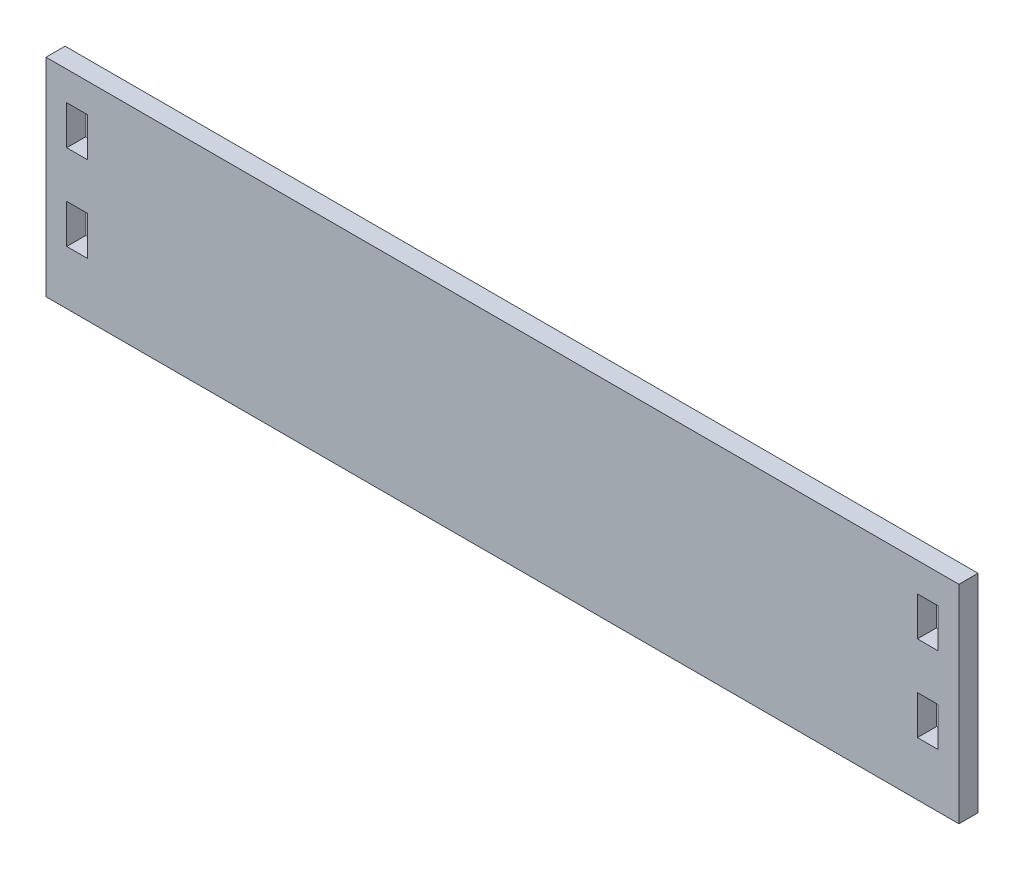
from build123d import *

# Parameters (mm, degrees)
SKETCH1_W           = 279.4
SKETCH1_H           = 63.5
SKETCH1_W_2         = 6.35
SKETCH1_H_2         = 11.938
BOSS_EXTRUDE1_DEPTH = 5.842


with BuildPart() as part:
    # Sketch1 → Boss-Extrude1 (new body)
    with BuildSketch(Plane.XY):
        with Locations((139.7, 31.75)):
            Rectangle(SKETCH1_W, SKETCH1_H)
        with Locations((9.525, 22.479)):
            Rectangle(SKETCH1_W_2, SKETCH1_H_2, mode=Mode.SUBTRACT)
        with Locations((9.525, 48.641)):
            Rectangle(SKETCH1_W_2, SKETCH1_H_2, mode=Mode.SUBTRACT)
        with Locations((269.875, 48.641)):
            Rectangle(SKETCH1_W_2, SKETCH1_H_2, mode=Mode.SUBTRACT)
        with Locations((269.875, 22.479)):
            Rectangle(SKETCH1_W_2, SKETCH1_H_2, mode=Mode.SUBTRACT)
    extrude(amount=BOSS_EXTRUDE1_DEPTH)


solid = part.part
